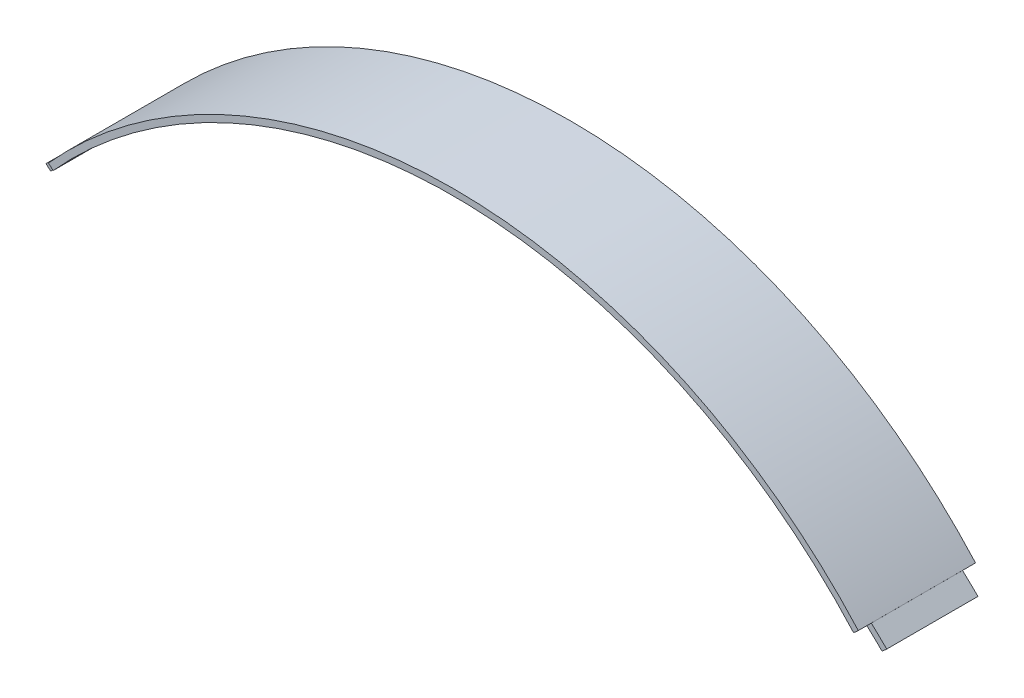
from build123d import *

# Parameters (mm, degrees)
EXTRUSION1_DEPTH = 55
EXTRUSION2_DEPTH = 21.4


with BuildPart() as part:
    # Esquisse1 → Extrusion1 (new body)
    with BuildSketch(Plane.XY):
        with BuildLine():
            Line((70, 22.393855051), (72.189230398, 20.423963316))
            ThreePointArc((72.189230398, 20.423963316), (259.994177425, 104.033559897), (447.800429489, 20.426894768))
            Line((447.800429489, 20.426894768), (450, 22.407722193))
            ThreePointArc((450, 22.407722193), (259.996911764, 107.02743321), (70, 22.393855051))
        make_face()
    extrude(amount=EXTRUSION1_DEPTH)

    # Esquisse3 → Extrusion2 (add, symmetric)
    with BuildSketch(Plane.XY.offset(27.5)):
        Polygon((62.741093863, 15.480996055), (64.935142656, 13.496938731), (72.189230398, 20.423963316), (70, 22.393855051), align=None)
        Polygon((457.258906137, 15.480996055), (455.064857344, 13.496938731), (447.810769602, 20.423963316), (450, 22.393855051), align=None)
    extrude(amount=EXTRUSION2_DEPTH, both=True)


with BuildPart() as extrusion2_piece_1:
    # of the separate pieces the step leaves, piece 1, a body of its own (extrusion2_pieces)
    add(part.part.solids().sort_by_distance((70, 22.393855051, 0))[0])


with BuildPart() as extrusion2_piece_2:
    # of the separate pieces the step leaves, piece 2, a body of its own (extrusion2_pieces)
    add(part.part.solids().sort_by_distance((457.258906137, 15.480996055, 6.1))[0])


solid = Compound([extrusion2_piece_1.part, extrusion2_piece_2.part])
